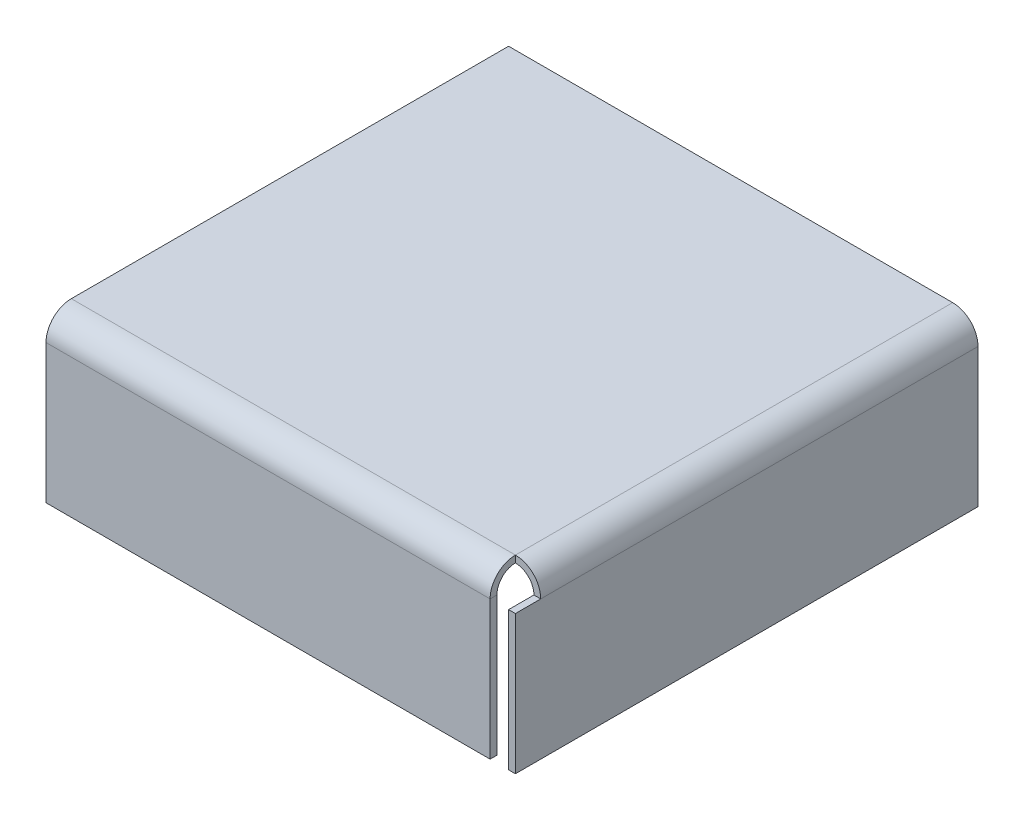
ISO-10303-21;
HEADER;
FILE_DESCRIPTION(('STEP AP214'),'2;1');
FILE_NAME('part.step','',(''),(''),'','','');
FILE_SCHEMA(('AUTOMOTIVE_DESIGN { 1 0 10303 214 1 1 1 1 }'));
ENDSEC;
DATA;
#1=APPLICATION_CONTEXT('core data for automotive mechanical design processes');
#2=APPLICATION_PROTOCOL_DEFINITION('international standard','automotive_design',2000,#1);
#3=PRODUCT_CONTEXT('',#1,'mechanical');
#4=PRODUCT('Part','Part','',(#3));
#5=PRODUCT_RELATED_PRODUCT_CATEGORY('part','',(#4));
#6=PRODUCT_DEFINITION_FORMATION('','',#4);
#7=PRODUCT_DEFINITION_CONTEXT('part definition',#1,'design');
#8=PRODUCT_DEFINITION('design','',#6,#7);
#9=PRODUCT_DEFINITION_SHAPE('','',#8);
#10=(LENGTH_UNIT() NAMED_UNIT(*) SI_UNIT(.MILLI.,.METRE.));
#11=(NAMED_UNIT(*) PLANE_ANGLE_UNIT() SI_UNIT($,.RADIAN.));
#12=(NAMED_UNIT(*) SI_UNIT($,.STERADIAN.) SOLID_ANGLE_UNIT());
#13=UNCERTAINTY_MEASURE_WITH_UNIT(LENGTH_MEASURE(1.E-05),#10,'distance_accuracy_value','');
#14=(GEOMETRIC_REPRESENTATION_CONTEXT(3) GLOBAL_UNCERTAINTY_ASSIGNED_CONTEXT((#13)) GLOBAL_UNIT_ASSIGNED_CONTEXT((#10,
#11,#12)) REPRESENTATION_CONTEXT('',''));
#15=CARTESIAN_POINT('',(0.,0.,0.));
#16=DIRECTION('',(0.,0.,1.));
#17=DIRECTION('',(1.,0.,0.));
#18=AXIS2_PLACEMENT_3D('',#15,#16,#17);
#19=CARTESIAN_POINT('',(23.,-1.99999999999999,22.2634));
#20=DIRECTION('',(1.,0.,0.));
#21=DIRECTION('',(0.,0.,-1.));
#22=AXIS2_PLACEMENT_3D('',#19,#20,#21);
#23=PLANE('',#22);
#24=DIRECTION('',(0.,0.,1.));
#25=VECTOR('',#24,1.);
#26=CARTESIAN_POINT('',(23.,-1.99999999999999,25.0000000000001));
#27=LINE('',#26,#25);
#28=CARTESIAN_POINT('',(23.,-1.99999999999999,24.2634));
#29=VERTEX_POINT('',#28);
#30=CARTESIAN_POINT('',(23.,-1.99999999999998,25.));
#31=VERTEX_POINT('',#30);
#32=EDGE_CURVE('E172',#29,#31,#27,.T.);
#33=ORIENTED_EDGE('',*,*,#32,.F.);
#34=CARTESIAN_POINT('',(23.,-1.99999999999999,22.2634));
#35=DIRECTION('',(-1.,0.,0.));
#36=DIRECTION('',(0.,0.,1.));
#37=AXIS2_PLACEMENT_3D('',#34,#35,#36);
#38=CIRCLE('',#37,2.);
#39=CARTESIAN_POINT('',(23.,0.,22.2634));
#40=VERTEX_POINT('',#39);
#41=EDGE_CURVE('E131',#40,#29,#38,.F.);
#42=ORIENTED_EDGE('',*,*,#41,.F.);
#43=DIRECTION('',(0.,1.,0.));
#44=VECTOR('',#43,1.);
#45=CARTESIAN_POINT('',(23.,0.,22.2634));
#46=LINE('',#45,#44);
#47=CARTESIAN_POINT('',(23.,0.736599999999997,22.2634));
#48=VERTEX_POINT('',#47);
#49=EDGE_CURVE('E11',#40,#48,#46,.T.);
#50=ORIENTED_EDGE('',*,*,#49,.T.);
#51=CARTESIAN_POINT('',(23.,-1.99999999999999,22.2634));
#52=DIRECTION('',(-1.,0.,0.));
#53=DIRECTION('',(0.,0.,1.));
#54=AXIS2_PLACEMENT_3D('',#51,#52,#53);
#55=CIRCLE('',#54,2.7366);
#56=EDGE_CURVE('E250',#48,#31,#55,.F.);
#57=ORIENTED_EDGE('',*,*,#56,.T.);
#58=EDGE_LOOP('',(#33,#42,#50,#57));
#59=FACE_BOUND('',#58,.T.);
#60=ADVANCED_FACE('F35',(#59),#23,.T.);
#61=CARTESIAN_POINT('',(-25.,-1.99999999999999,22.2634));
#62=DIRECTION('',(1.,0.,0.));
#63=DIRECTION('',(0.,0.,-1.));
#64=AXIS2_PLACEMENT_3D('',#61,#62,#63);
#65=PLANE('',#64);
#66=CARTESIAN_POINT('',(-25.,-1.99999999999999,22.2634));
#67=DIRECTION('',(-1.,0.,0.));
#68=DIRECTION('',(0.,0.,1.));
#69=AXIS2_PLACEMENT_3D('',#66,#67,#68);
#70=CIRCLE('',#69,2.);
#71=CARTESIAN_POINT('',(-25.,-1.99999999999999,24.2634));
#72=VERTEX_POINT('',#71);
#73=CARTESIAN_POINT('',(-25.,0.,22.2634));
#74=VERTEX_POINT('',#73);
#75=EDGE_CURVE('E137',#72,#74,#70,.T.);
#76=ORIENTED_EDGE('',*,*,#75,.F.);
#77=DIRECTION('',(0.,0.,1.));
#78=VECTOR('',#77,1.);
#79=CARTESIAN_POINT('',(-25.,-1.99999999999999,24.2634));
#80=LINE('',#79,#78);
#81=CARTESIAN_POINT('',(-25.,-1.99999999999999,25.));
#82=VERTEX_POINT('',#81);
#83=EDGE_CURVE('E135',#72,#82,#80,.T.);
#84=ORIENTED_EDGE('',*,*,#83,.T.);
#85=CARTESIAN_POINT('',(-25.,-1.99999999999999,22.2634));
#86=DIRECTION('',(-1.,0.,0.));
#87=DIRECTION('',(0.,0.,1.));
#88=AXIS2_PLACEMENT_3D('',#85,#86,#87);
#89=CIRCLE('',#88,2.7366);
#90=CARTESIAN_POINT('',(-25.,0.736600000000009,22.2634));
#91=VERTEX_POINT('',#90);
#92=EDGE_CURVE('E126',#82,#91,#89,.T.);
#93=ORIENTED_EDGE('',*,*,#92,.T.);
#94=DIRECTION('',(0.,1.,0.));
#95=VECTOR('',#94,1.);
#96=CARTESIAN_POINT('',(-25.,0.,22.2634));
#97=LINE('',#96,#95);
#98=EDGE_CURVE('E39',#74,#91,#97,.T.);
#99=ORIENTED_EDGE('',*,*,#98,.F.);
#100=EDGE_LOOP('',(#76,#84,#93,#99));
#101=FACE_BOUND('',#100,.T.);
#102=ADVANCED_FACE('F37',(#101),#65,.F.);
#103=CARTESIAN_POINT('',(-25.,-1.99999999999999,22.2634));
#104=DIRECTION('',(-1.,0.,0.));
#105=DIRECTION('',(0.,0.,1.));
#106=AXIS2_PLACEMENT_3D('',#103,#104,#105);
#107=CYLINDRICAL_SURFACE('',#106,2.7366);
#108=DIRECTION('',(-1.,0.,0.));
#109=VECTOR('',#108,1.);
#110=CARTESIAN_POINT('',(-25.,0.736600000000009,22.2634));
#111=LINE('',#110,#109);
#112=EDGE_CURVE('E50',#91,#48,#111,.F.);
#113=ORIENTED_EDGE('',*,*,#112,.F.);
#114=ORIENTED_EDGE('',*,*,#92,.F.);
#115=DIRECTION('',(-1.,0.,0.));
#116=VECTOR('',#115,1.);
#117=CARTESIAN_POINT('',(-25.,-1.99999999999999,25.));
#118=LINE('',#117,#116);
#119=EDGE_CURVE('E55',#31,#82,#118,.T.);
#120=ORIENTED_EDGE('',*,*,#119,.F.);
#121=ORIENTED_EDGE('',*,*,#56,.F.);
#122=EDGE_LOOP('',(#113,#114,#120,#121));
#123=FACE_BOUND('',#122,.T.);
#124=ADVANCED_FACE('F128',(#123),#107,.T.);
#125=CARTESIAN_POINT('',(-25.,-1.99999999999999,22.2634));
#126=DIRECTION('',(-1.,0.,0.));
#127=DIRECTION('',(0.,0.,1.));
#128=AXIS2_PLACEMENT_3D('',#125,#126,#127);
#129=CYLINDRICAL_SURFACE('',#128,2.);
#130=DIRECTION('',(-1.,0.,0.));
#131=VECTOR('',#130,1.);
#132=CARTESIAN_POINT('',(-25.,0.,22.2634));
#133=LINE('',#132,#131);
#134=EDGE_CURVE('E246',#74,#40,#133,.F.);
#135=ORIENTED_EDGE('',*,*,#134,.T.);
#136=ORIENTED_EDGE('',*,*,#41,.T.);
#137=DIRECTION('',(1.,0.,0.));
#138=VECTOR('',#137,1.);
#139=CARTESIAN_POINT('',(23.,-1.99999999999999,24.2634));
#140=LINE('',#139,#138);
#141=EDGE_CURVE('E142',#29,#72,#140,.F.);
#142=ORIENTED_EDGE('',*,*,#141,.T.);
#143=ORIENTED_EDGE('',*,*,#75,.T.);
#144=EDGE_LOOP('',(#135,#136,#142,#143));
#145=FACE_BOUND('',#144,.T.);
#146=ADVANCED_FACE('F273',(#145),#129,.F.);
#147=CARTESIAN_POINT('',(25.,-1.99999999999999,22.2634));
#148=DIRECTION('',(0.,-1.,0.));
#149=DIRECTION('',(1.,0.,0.));
#150=AXIS2_PLACEMENT_3D('',#147,#148,#149);
#151=PLANE('',#150);
#152=DIRECTION('',(1.,0.,0.));
#153=VECTOR('',#152,1.);
#154=CARTESIAN_POINT('',(25.,-1.99999999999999,22.2634));
#155=LINE('',#154,#153);
#156=CARTESIAN_POINT('',(25.,-1.99999999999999,22.2634));
#157=VERTEX_POINT('',#156);
#158=CARTESIAN_POINT('',(25.7366,-1.99999999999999,22.2634));
#159=VERTEX_POINT('',#158);
#160=EDGE_CURVE('E242',#157,#159,#155,.T.);
#161=ORIENTED_EDGE('',*,*,#160,.F.);
#162=DIRECTION('',(0.,0.,1.));
#163=VECTOR('',#162,1.);
#164=CARTESIAN_POINT('',(25.,-1.99999999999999,-25.));
#165=LINE('',#164,#163);
#166=CARTESIAN_POINT('',(25.,-1.99999999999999,25.));
#167=VERTEX_POINT('',#166);
#168=EDGE_CURVE('E179',#157,#167,#165,.T.);
#169=ORIENTED_EDGE('',*,*,#168,.T.);
#170=DIRECTION('',(1.,0.,0.));
#171=VECTOR('',#170,1.);
#172=CARTESIAN_POINT('',(25.,-1.99999999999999,25.));
#173=LINE('',#172,#171);
#174=CARTESIAN_POINT('',(25.7366,-1.99999999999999,25.));
#175=VERTEX_POINT('',#174);
#176=EDGE_CURVE('E178',#167,#175,#173,.T.);
#177=ORIENTED_EDGE('',*,*,#176,.T.);
#178=DIRECTION('',(0.,0.,1.));
#179=VECTOR('',#178,1.);
#180=CARTESIAN_POINT('',(25.7366,-1.99999999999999,25.));
#181=LINE('',#180,#179);
#182=EDGE_CURVE('E182',#159,#175,#181,.T.);
#183=ORIENTED_EDGE('',*,*,#182,.F.);
#184=EDGE_LOOP('',(#161,#169,#177,#183));
#185=FACE_BOUND('',#184,.T.);
#186=ADVANCED_FACE('F290',(#185),#151,.F.);
#187=CARTESIAN_POINT('',(23.,-2.,25.));
#188=DIRECTION('',(0.,0.,1.));
#189=DIRECTION('',(1.,0.,0.));
#190=AXIS2_PLACEMENT_3D('',#187,#188,#189);
#191=CYLINDRICAL_SURFACE('',#190,2.73659999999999);
#192=DIRECTION('',(0.,0.,1.));
#193=VECTOR('',#192,1.);
#194=CARTESIAN_POINT('',(23.,0.736599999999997,25.));
#195=LINE('',#194,#193);
#196=CARTESIAN_POINT('',(23.,0.7366,-25.));
#197=VERTEX_POINT('',#196);
#198=EDGE_CURVE('E227',#48,#197,#195,.F.);
#199=ORIENTED_EDGE('',*,*,#198,.F.);
#200=CARTESIAN_POINT('',(23.,-2.,22.2634));
#201=DIRECTION('',(0.,0.,1.));
#202=DIRECTION('',(0.,-1.,0.));
#203=AXIS2_PLACEMENT_3D('',#200,#201,#202);
#204=CIRCLE('',#203,2.73659999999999);
#205=EDGE_CURVE('E239',#48,#159,#204,.F.);
#206=ORIENTED_EDGE('',*,*,#205,.T.);
#207=CARTESIAN_POINT('',(25.7366,-1.99999999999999,-25.));
#208=VERTEX_POINT('',#207);
#209=EDGE_CURVE('E186',#208,#159,#181,.T.);
#210=ORIENTED_EDGE('',*,*,#209,.F.);
#211=CARTESIAN_POINT('',(23.,-2.,-25.));
#212=DIRECTION('',(0.,0.,1.));
#213=DIRECTION('',(1.,0.,0.));
#214=AXIS2_PLACEMENT_3D('',#211,#212,#213);
#215=CIRCLE('',#214,2.73659999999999);
#216=EDGE_CURVE('E230',#197,#208,#215,.F.);
#217=ORIENTED_EDGE('',*,*,#216,.F.);
#218=EDGE_LOOP('',(#199,#206,#210,#217));
#219=FACE_BOUND('',#218,.T.);
#220=ADVANCED_FACE('F298',(#219),#191,.T.);
#221=CARTESIAN_POINT('',(23.,-2.,22.2634));
#222=DIRECTION('',(0.,0.,1.));
#223=DIRECTION('',(0.,-1.,0.));
#224=AXIS2_PLACEMENT_3D('',#221,#222,#223);
#225=PLANE('',#224);
#226=CARTESIAN_POINT('',(23.,-2.,22.2634));
#227=DIRECTION('',(0.,0.,1.));
#228=DIRECTION('',(0.,-1.,0.));
#229=AXIS2_PLACEMENT_3D('',#226,#227,#228);
#230=CIRCLE('',#229,1.99999999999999);
#231=EDGE_CURVE('E236',#40,#157,#230,.F.);
#232=ORIENTED_EDGE('',*,*,#231,.T.);
#233=ORIENTED_EDGE('',*,*,#160,.T.);
#234=ORIENTED_EDGE('',*,*,#205,.F.);
#235=ORIENTED_EDGE('',*,*,#49,.F.);
#236=EDGE_LOOP('',(#232,#233,#234,#235));
#237=FACE_BOUND('',#236,.T.);
#238=ADVANCED_FACE('F283',(#237),#225,.T.);
#239=CARTESIAN_POINT('',(-25.,0.7366,25.));
#240=DIRECTION('',(0.,1.,0.));
#241=DIRECTION('',(0.,0.,1.));
#242=AXIS2_PLACEMENT_3D('',#239,#240,#241);
#243=PLANE('',#242);
#244=DIRECTION('',(0.,0.,1.));
#245=VECTOR('',#244,1.);
#246=CARTESIAN_POINT('',(-25.,0.7366,-25.));
#247=LINE('',#246,#245);
#248=CARTESIAN_POINT('',(-25.,0.7366,-25.));
#249=VERTEX_POINT('',#248);
#250=EDGE_CURVE('E215',#249,#91,#247,.T.);
#251=ORIENTED_EDGE('',*,*,#250,.T.);
#252=ORIENTED_EDGE('',*,*,#112,.T.);
#253=ORIENTED_EDGE('',*,*,#198,.T.);
#254=DIRECTION('',(-1.,0.,0.));
#255=VECTOR('',#254,1.);
#256=CARTESIAN_POINT('',(-25.,0.7366,-25.));
#257=LINE('',#256,#255);
#258=EDGE_CURVE('E218',#197,#249,#257,.T.);
#259=ORIENTED_EDGE('',*,*,#258,.T.);
#260=EDGE_LOOP('',(#251,#252,#253,#259));
#261=FACE_BOUND('',#260,.T.);
#262=ADVANCED_FACE('F258',(#261),#243,.T.);
#263=CARTESIAN_POINT('',(-25.,0.,25.));
#264=DIRECTION('',(0.,1.,0.));
#265=DIRECTION('',(0.,0.,1.));
#266=AXIS2_PLACEMENT_3D('',#263,#264,#265);
#267=PLANE('',#266);
#268=ORIENTED_EDGE('',*,*,#134,.F.);
#269=DIRECTION('',(0.,0.,1.));
#270=VECTOR('',#269,1.);
#271=CARTESIAN_POINT('',(-25.,0.,-25.));
#272=LINE('',#271,#270);
#273=CARTESIAN_POINT('',(-25.,0.,-25.));
#274=VERTEX_POINT('',#273);
#275=EDGE_CURVE('E208',#274,#74,#272,.T.);
#276=ORIENTED_EDGE('',*,*,#275,.F.);
#277=DIRECTION('',(-1.,0.,0.));
#278=VECTOR('',#277,1.);
#279=CARTESIAN_POINT('',(-25.,0.,-25.));
#280=LINE('',#279,#278);
#281=CARTESIAN_POINT('',(23.,0.,-25.));
#282=VERTEX_POINT('',#281);
#283=EDGE_CURVE('E213',#282,#274,#280,.T.);
#284=ORIENTED_EDGE('',*,*,#283,.F.);
#285=DIRECTION('',(0.,0.,1.));
#286=VECTOR('',#285,1.);
#287=CARTESIAN_POINT('',(23.,0.,25.));
#288=LINE('',#287,#286);
#289=EDGE_CURVE('E223',#40,#282,#288,.F.);
#290=ORIENTED_EDGE('',*,*,#289,.F.);
#291=EDGE_LOOP('',(#268,#276,#284,#290));
#292=FACE_BOUND('',#291,.T.);
#293=ADVANCED_FACE('F268',(#292),#267,.F.);
#294=CARTESIAN_POINT('',(-25.,0.7366,-25.));
#295=DIRECTION('',(1.,0.,0.));
#296=DIRECTION('',(0.,0.,-1.));
#297=AXIS2_PLACEMENT_3D('',#294,#295,#296);
#298=PLANE('',#297);
#299=ORIENTED_EDGE('',*,*,#98,.T.);
#300=ORIENTED_EDGE('',*,*,#250,.F.);
#301=DIRECTION('',(0.,-1.,0.));
#302=VECTOR('',#301,1.);
#303=CARTESIAN_POINT('',(-25.,0.7366,-25.));
#304=LINE('',#303,#302);
#305=EDGE_CURVE('E220',#249,#274,#304,.T.);
#306=ORIENTED_EDGE('',*,*,#305,.T.);
#307=ORIENTED_EDGE('',*,*,#275,.T.);
#308=EDGE_LOOP('',(#299,#300,#306,#307));
#309=FACE_BOUND('',#308,.T.);
#310=ADVANCED_FACE('F254',(#309),#298,.F.);
#311=CARTESIAN_POINT('',(23.,-2.,-25.));
#312=DIRECTION('',(0.,0.,-1.));
#313=DIRECTION('',(-1.,0.,0.));
#314=AXIS2_PLACEMENT_3D('',#311,#312,#313);
#315=PLANE('',#314);
#316=DIRECTION('',(1.,0.,0.));
#317=VECTOR('',#316,1.);
#318=CARTESIAN_POINT('',(25.,-1.99999999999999,-25.));
#319=LINE('',#318,#317);
#320=CARTESIAN_POINT('',(25.,-1.99999999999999,-25.));
#321=VERTEX_POINT('',#320);
#322=EDGE_CURVE('E183',#321,#208,#319,.T.);
#323=ORIENTED_EDGE('',*,*,#322,.F.);
#324=CARTESIAN_POINT('',(23.,-2.,-25.));
#325=DIRECTION('',(0.,0.,1.));
#326=DIRECTION('',(1.,0.,0.));
#327=AXIS2_PLACEMENT_3D('',#324,#325,#326);
#328=CIRCLE('',#327,1.99999999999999);
#329=EDGE_CURVE('E224',#282,#321,#328,.F.);
#330=ORIENTED_EDGE('',*,*,#329,.F.);
#331=DIRECTION('',(0.,1.,0.));
#332=VECTOR('',#331,1.);
#333=CARTESIAN_POINT('',(23.,0.,-25.));
#334=LINE('',#333,#332);
#335=EDGE_CURVE('E233',#282,#197,#334,.T.);
#336=ORIENTED_EDGE('',*,*,#335,.T.);
#337=ORIENTED_EDGE('',*,*,#216,.T.);
#338=EDGE_LOOP('',(#323,#330,#336,#337));
#339=FACE_BOUND('',#338,.T.);
#340=ADVANCED_FACE('F300',(#339),#315,.T.);
#341=CARTESIAN_POINT('',(23.,-2.,25.));
#342=DIRECTION('',(0.,0.,1.));
#343=DIRECTION('',(1.,0.,0.));
#344=AXIS2_PLACEMENT_3D('',#341,#342,#343);
#345=CYLINDRICAL_SURFACE('',#344,1.99999999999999);
#346=ORIENTED_EDGE('',*,*,#231,.F.);
#347=ORIENTED_EDGE('',*,*,#289,.T.);
#348=ORIENTED_EDGE('',*,*,#329,.T.);
#349=EDGE_CURVE('E175',#321,#157,#165,.T.);
#350=ORIENTED_EDGE('',*,*,#349,.T.);
#351=EDGE_LOOP('',(#346,#347,#348,#350));
#352=FACE_BOUND('',#351,.T.);
#353=ADVANCED_FACE('F278',(#352),#345,.F.);
#354=CARTESIAN_POINT('',(-25.,0.7366,-25.));
#355=DIRECTION('',(0.,0.,1.));
#356=DIRECTION('',(1.,0.,0.));
#357=AXIS2_PLACEMENT_3D('',#354,#355,#356);
#358=PLANE('',#357);
#359=ORIENTED_EDGE('',*,*,#335,.F.);
#360=ORIENTED_EDGE('',*,*,#283,.T.);
#361=ORIENTED_EDGE('',*,*,#305,.F.);
#362=ORIENTED_EDGE('',*,*,#258,.F.);
#363=EDGE_LOOP('',(#359,#360,#361,#362));
#364=FACE_BOUND('',#363,.T.);
#365=ADVANCED_FACE('F265',(#364),#358,.F.);
#366=CARTESIAN_POINT('',(25.7366,0.,25.));
#367=DIRECTION('',(0.,0.,1.));
#368=DIRECTION('',(0.,-1.,0.));
#369=AXIS2_PLACEMENT_3D('',#366,#367,#368);
#370=PLANE('',#369);
#371=DIRECTION('',(0.,1.,0.));
#372=VECTOR('',#371,1.);
#373=CARTESIAN_POINT('',(25.7366,0.,25.));
#374=LINE('',#373,#372);
#375=CARTESIAN_POINT('',(25.7366000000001,-17.,25.));
#376=VERTEX_POINT('',#375);
#377=EDGE_CURVE('E202',#376,#175,#374,.T.);
#378=ORIENTED_EDGE('',*,*,#377,.T.);
#379=ORIENTED_EDGE('',*,*,#176,.F.);
#380=DIRECTION('',(0.,1.,0.));
#381=VECTOR('',#380,1.);
#382=CARTESIAN_POINT('',(25.,0.,25.));
#383=LINE('',#382,#381);
#384=CARTESIAN_POINT('',(25.0000000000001,-17.,25.));
#385=VERTEX_POINT('',#384);
#386=EDGE_CURVE('E194',#385,#167,#383,.T.);
#387=ORIENTED_EDGE('',*,*,#386,.F.);
#388=DIRECTION('',(-1.,0.,0.));
#389=VECTOR('',#388,1.);
#390=CARTESIAN_POINT('',(25.7366000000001,-17.,25.));
#391=LINE('',#390,#389);
#392=EDGE_CURVE('E206',#376,#385,#391,.T.);
#393=ORIENTED_EDGE('',*,*,#392,.F.);
#394=EDGE_LOOP('',(#378,#379,#387,#393));
#395=FACE_BOUND('',#394,.T.);
#396=ADVANCED_FACE('F307',(#395),#370,.T.);
#397=CARTESIAN_POINT('',(25.7366000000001,-17.,-25.));
#398=DIRECTION('',(0.,0.,-1.));
#399=DIRECTION('',(0.,1.,0.));
#400=AXIS2_PLACEMENT_3D('',#397,#398,#399);
#401=PLANE('',#400);
#402=DIRECTION('',(0.,-1.,0.));
#403=VECTOR('',#402,1.);
#404=CARTESIAN_POINT('',(25.0000000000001,-17.,-25.));
#405=LINE('',#404,#403);
#406=CARTESIAN_POINT('',(25.0000000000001,-17.,-25.));
#407=VERTEX_POINT('',#406);
#408=EDGE_CURVE('E189',#321,#407,#405,.T.);
#409=ORIENTED_EDGE('',*,*,#408,.F.);
#410=ORIENTED_EDGE('',*,*,#322,.T.);
#411=DIRECTION('',(0.,-1.,0.));
#412=VECTOR('',#411,1.);
#413=CARTESIAN_POINT('',(25.7366000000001,-17.,-25.));
#414=LINE('',#413,#412);
#415=CARTESIAN_POINT('',(25.7366000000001,-17.,-25.));
#416=VERTEX_POINT('',#415);
#417=EDGE_CURVE('E197',#208,#416,#414,.T.);
#418=ORIENTED_EDGE('',*,*,#417,.T.);
#419=DIRECTION('',(-1.,0.,0.));
#420=VECTOR('',#419,1.);
#421=CARTESIAN_POINT('',(25.7366000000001,-17.,-25.));
#422=LINE('',#421,#420);
#423=EDGE_CURVE('E205',#416,#407,#422,.T.);
#424=ORIENTED_EDGE('',*,*,#423,.T.);
#425=EDGE_LOOP('',(#409,#410,#418,#424));
#426=FACE_BOUND('',#425,.T.);
#427=ADVANCED_FACE('F302',(#426),#401,.T.);
#428=CARTESIAN_POINT('',(25.7366,0.,25.));
#429=DIRECTION('',(1.,0.,0.));
#430=DIRECTION('',(0.,1.,0.));
#431=AXIS2_PLACEMENT_3D('',#428,#429,#430);
#432=PLANE('',#431);
#433=ORIENTED_EDGE('',*,*,#417,.F.);
#434=ORIENTED_EDGE('',*,*,#209,.T.);
#435=ORIENTED_EDGE('',*,*,#182,.T.);
#436=ORIENTED_EDGE('',*,*,#377,.F.);
#437=DIRECTION('',(0.,0.,1.));
#438=VECTOR('',#437,1.);
#439=CARTESIAN_POINT('',(25.7366000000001,-17.,25.));
#440=LINE('',#439,#438);
#441=EDGE_CURVE('E199',#416,#376,#440,.T.);
#442=ORIENTED_EDGE('',*,*,#441,.F.);
#443=EDGE_LOOP('',(#433,#434,#435,#436,#442));
#444=FACE_BOUND('',#443,.T.);
#445=ADVANCED_FACE('F295',(#444),#432,.T.);
#446=CARTESIAN_POINT('',(25.,0.,25.));
#447=DIRECTION('',(1.,0.,0.));
#448=DIRECTION('',(0.,1.,0.));
#449=AXIS2_PLACEMENT_3D('',#446,#447,#448);
#450=PLANE('',#449);
#451=ORIENTED_EDGE('',*,*,#349,.F.);
#452=ORIENTED_EDGE('',*,*,#408,.T.);
#453=DIRECTION('',(0.,0.,1.));
#454=VECTOR('',#453,1.);
#455=CARTESIAN_POINT('',(25.0000000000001,-17.,25.));
#456=LINE('',#455,#454);
#457=EDGE_CURVE('E191',#407,#385,#456,.T.);
#458=ORIENTED_EDGE('',*,*,#457,.T.);
#459=ORIENTED_EDGE('',*,*,#386,.T.);
#460=ORIENTED_EDGE('',*,*,#168,.F.);
#461=EDGE_LOOP('',(#451,#452,#458,#459,#460));
#462=FACE_BOUND('',#461,.T.);
#463=ADVANCED_FACE('F285',(#462),#450,.F.);
#464=CARTESIAN_POINT('',(25.7366000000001,-17.,25.));
#465=DIRECTION('',(0.,-1.,0.));
#466=DIRECTION('',(1.,0.,0.));
#467=AXIS2_PLACEMENT_3D('',#464,#465,#466);
#468=PLANE('',#467);
#469=ORIENTED_EDGE('',*,*,#457,.F.);
#470=ORIENTED_EDGE('',*,*,#423,.F.);
#471=ORIENTED_EDGE('',*,*,#441,.T.);
#472=ORIENTED_EDGE('',*,*,#392,.T.);
#473=EDGE_LOOP('',(#469,#470,#471,#472));
#474=FACE_BOUND('',#473,.T.);
#475=ADVANCED_FACE('F308',(#474),#468,.T.);
#476=CARTESIAN_POINT('',(-25.,0.,25.));
#477=DIRECTION('',(-1.,0.,0.));
#478=DIRECTION('',(0.,0.,1.));
#479=AXIS2_PLACEMENT_3D('',#476,#477,#478);
#480=PLANE('',#479);
#481=DIRECTION('',(0.,1.,0.));
#482=VECTOR('',#481,1.);
#483=CARTESIAN_POINT('',(-25.,0.,25.));
#484=LINE('',#483,#482);
#485=CARTESIAN_POINT('',(-25.,-17.,25.0000000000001));
#486=VERTEX_POINT('',#485);
#487=EDGE_CURVE('E149',#486,#82,#484,.T.);
#488=ORIENTED_EDGE('',*,*,#487,.T.);
#489=ORIENTED_EDGE('',*,*,#83,.F.);
#490=DIRECTION('',(0.,-1.,0.));
#491=VECTOR('',#490,1.);
#492=CARTESIAN_POINT('',(-25.,0.,24.2634));
#493=LINE('',#492,#491);
#494=CARTESIAN_POINT('',(-25.,-17.,24.2634000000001));
#495=VERTEX_POINT('',#494);
#496=EDGE_CURVE('E165',#495,#72,#493,.F.);
#497=ORIENTED_EDGE('',*,*,#496,.F.);
#498=DIRECTION('',(0.,0.,-1.));
#499=VECTOR('',#498,1.);
#500=CARTESIAN_POINT('',(-25.,-17.,25.0000000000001));
#501=LINE('',#500,#499);
#502=EDGE_CURVE('E154',#486,#495,#501,.T.);
#503=ORIENTED_EDGE('',*,*,#502,.F.);
#504=EDGE_LOOP('',(#488,#489,#497,#503));
#505=FACE_BOUND('',#504,.T.);
#506=ADVANCED_FACE('F153',(#505),#480,.T.);
#507=CARTESIAN_POINT('',(23.,-17.,25.0000000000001));
#508=DIRECTION('',(1.,0.,0.));
#509=DIRECTION('',(0.,0.,-1.));
#510=AXIS2_PLACEMENT_3D('',#507,#508,#509);
#511=PLANE('',#510);
#512=DIRECTION('',(0.,1.,0.));
#513=VECTOR('',#512,1.);
#514=CARTESIAN_POINT('',(23.,0.,24.2634));
#515=LINE('',#514,#513);
#516=CARTESIAN_POINT('',(23.,-17.,24.2634000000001));
#517=VERTEX_POINT('',#516);
#518=EDGE_CURVE('E151',#29,#517,#515,.F.);
#519=ORIENTED_EDGE('',*,*,#518,.F.);
#520=ORIENTED_EDGE('',*,*,#32,.T.);
#521=DIRECTION('',(0.,-1.,0.));
#522=VECTOR('',#521,1.);
#523=CARTESIAN_POINT('',(23.,-17.,25.0000000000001));
#524=LINE('',#523,#522);
#525=CARTESIAN_POINT('',(23.,-17.,25.0000000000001));
#526=VERTEX_POINT('',#525);
#527=EDGE_CURVE('E150',#31,#526,#524,.T.);
#528=ORIENTED_EDGE('',*,*,#527,.T.);
#529=DIRECTION('',(0.,0.,-1.));
#530=VECTOR('',#529,1.);
#531=CARTESIAN_POINT('',(23.,-17.,25.0000000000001));
#532=LINE('',#531,#530);
#533=EDGE_CURVE('E156',#526,#517,#532,.T.);
#534=ORIENTED_EDGE('',*,*,#533,.T.);
#535=EDGE_LOOP('',(#519,#520,#528,#534));
#536=FACE_BOUND('',#535,.T.);
#537=ADVANCED_FACE('F315',(#536),#511,.T.);
#538=CARTESIAN_POINT('',(-25.,0.,25.));
#539=DIRECTION('',(0.,0.,1.));
#540=DIRECTION('',(0.,-1.,0.));
#541=AXIS2_PLACEMENT_3D('',#538,#539,#540);
#542=PLANE('',#541);
#543=ORIENTED_EDGE('',*,*,#527,.F.);
#544=ORIENTED_EDGE('',*,*,#119,.T.);
#545=ORIENTED_EDGE('',*,*,#487,.F.);
#546=DIRECTION('',(-1.,0.,0.));
#547=VECTOR('',#546,1.);
#548=CARTESIAN_POINT('',(-25.,-17.,25.0000000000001));
#549=LINE('',#548,#547);
#550=EDGE_CURVE('E157',#526,#486,#549,.T.);
#551=ORIENTED_EDGE('',*,*,#550,.F.);
#552=EDGE_LOOP('',(#543,#544,#545,#551));
#553=FACE_BOUND('',#552,.T.);
#554=ADVANCED_FACE('F147',(#553),#542,.T.);
#555=CARTESIAN_POINT('',(-25.,0.,24.2634));
#556=DIRECTION('',(0.,0.,1.));
#557=DIRECTION('',(0.,-1.,0.));
#558=AXIS2_PLACEMENT_3D('',#555,#556,#557);
#559=PLANE('',#558);
#560=ORIENTED_EDGE('',*,*,#141,.F.);
#561=ORIENTED_EDGE('',*,*,#518,.T.);
#562=DIRECTION('',(1.,0.,0.));
#563=VECTOR('',#562,1.);
#564=CARTESIAN_POINT('',(-25.,-17.,24.2634000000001));
#565=LINE('',#564,#563);
#566=EDGE_CURVE('E167',#517,#495,#565,.F.);
#567=ORIENTED_EDGE('',*,*,#566,.T.);
#568=ORIENTED_EDGE('',*,*,#496,.T.);
#569=EDGE_LOOP('',(#560,#561,#567,#568));
#570=FACE_BOUND('',#569,.T.);
#571=ADVANCED_FACE('F362',(#570),#559,.F.);
#572=CARTESIAN_POINT('',(-25.,-17.,25.0000000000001));
#573=DIRECTION('',(0.,-1.,0.));
#574=DIRECTION('',(0.,0.,-1.));
#575=AXIS2_PLACEMENT_3D('',#572,#573,#574);
#576=PLANE('',#575);
#577=ORIENTED_EDGE('',*,*,#566,.F.);
#578=ORIENTED_EDGE('',*,*,#533,.F.);
#579=ORIENTED_EDGE('',*,*,#550,.T.);
#580=ORIENTED_EDGE('',*,*,#502,.T.);
#581=EDGE_LOOP('',(#577,#578,#579,#580));
#582=FACE_BOUND('',#581,.T.);
#583=ADVANCED_FACE('F360',(#582),#576,.T.);
#584=CLOSED_SHELL('',(#60,#102,#124,#146,#186,#220,#238,#262,#293,#310,#340,#353,#365,#396,#427,
#445,#463,#475,#506,#537,#554,#571,#583));
#585=MANIFOLD_SOLID_BREP('B2',#584);
#586=ADVANCED_BREP_SHAPE_REPRESENTATION('',(#18,#585),#14);
#587=SHAPE_DEFINITION_REPRESENTATION(#9,#586);
ENDSEC;
END-ISO-10303-21;
